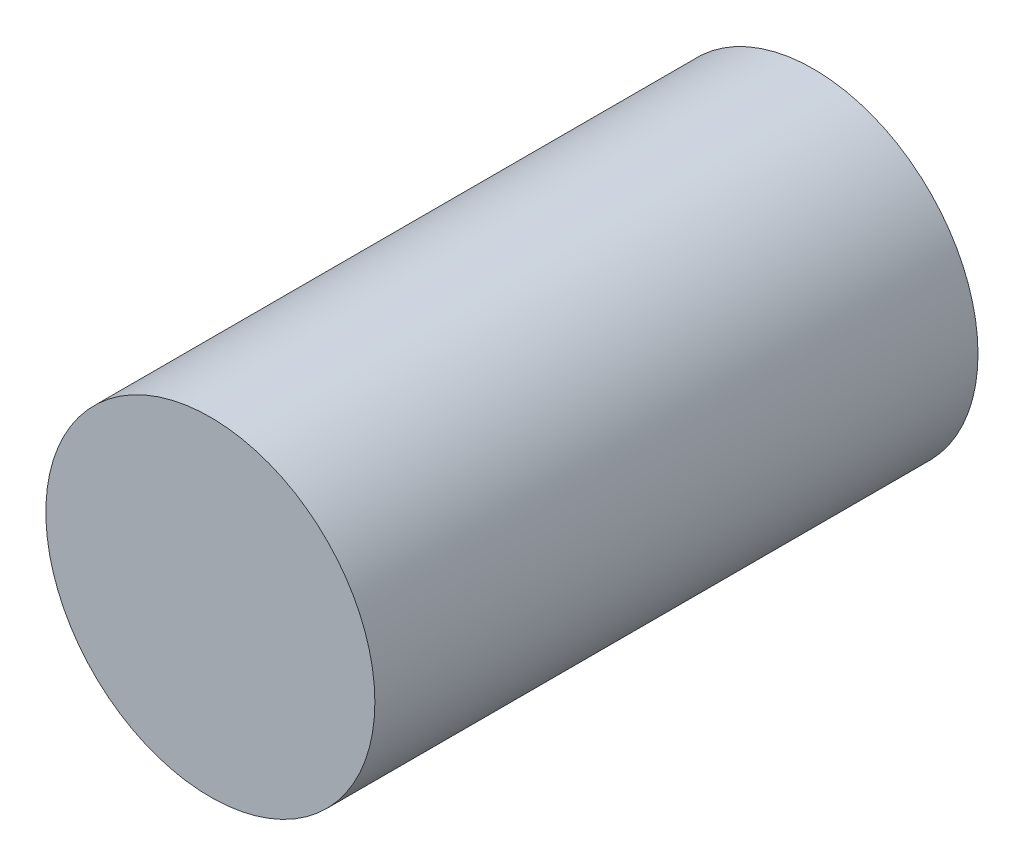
from build123d import *

# Parameters (mm, degrees)
SKETCH1_R           = 36.3728
BOSS_EXTRUDE1_DEPTH = 133.35


with BuildPart() as part:
    # Sketch1 → Boss-Extrude1 (new body)
    with BuildSketch(Plane.XY):
        Circle(SKETCH1_R)
    extrude(amount=BOSS_EXTRUDE1_DEPTH)


solid = part.part
